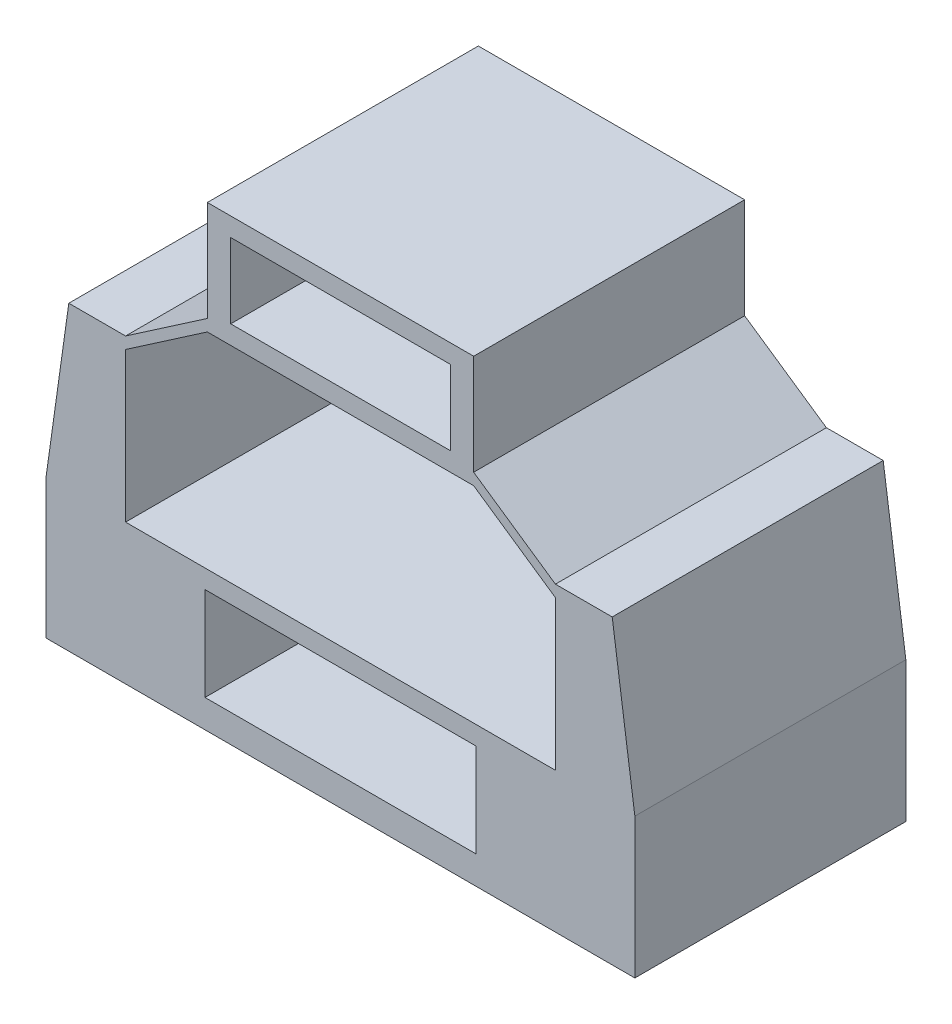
from build123d import *

# Parameters (mm, degrees)
MODEL_W         = 5.8
MODEL_H         = 2
MODEL_W_2       = 4.7
MODEL_H_2       = 1.6
EXTRUDE_1_DEPTH = 5.8


with BuildPart() as part:
    # Model → Extrude 1 (new body)
    with BuildSketch(Plane.XY):
        Polygon((2.85, 7.65), (4.6, 6.45), (5.81513412, 6.45), (6.3, 3), (6.3, 0), (-6.3, 0), (-6.3, 3), (-5.81513412, 6.45), (-4.6, 6.45), (-2.85, 7.65), (-2.85, 9.8), (2.85, 9.8), align=None)
        with Locations((0, 1.6)):
            Rectangle(MODEL_W, MODEL_H, mode=Mode.SUBTRACT)
        Polygon((4.6, 6.2), (2.85, 7.4), (-2.85, 7.4), (-4.6, 6.2), (-4.6, 3), (4.6, 3), align=None, mode=Mode.SUBTRACT)
        with Locations((0, 8.6)):
            Rectangle(MODEL_W_2, MODEL_H_2, mode=Mode.SUBTRACT)
    extrude(amount=EXTRUDE_1_DEPTH)


solid = part.part
